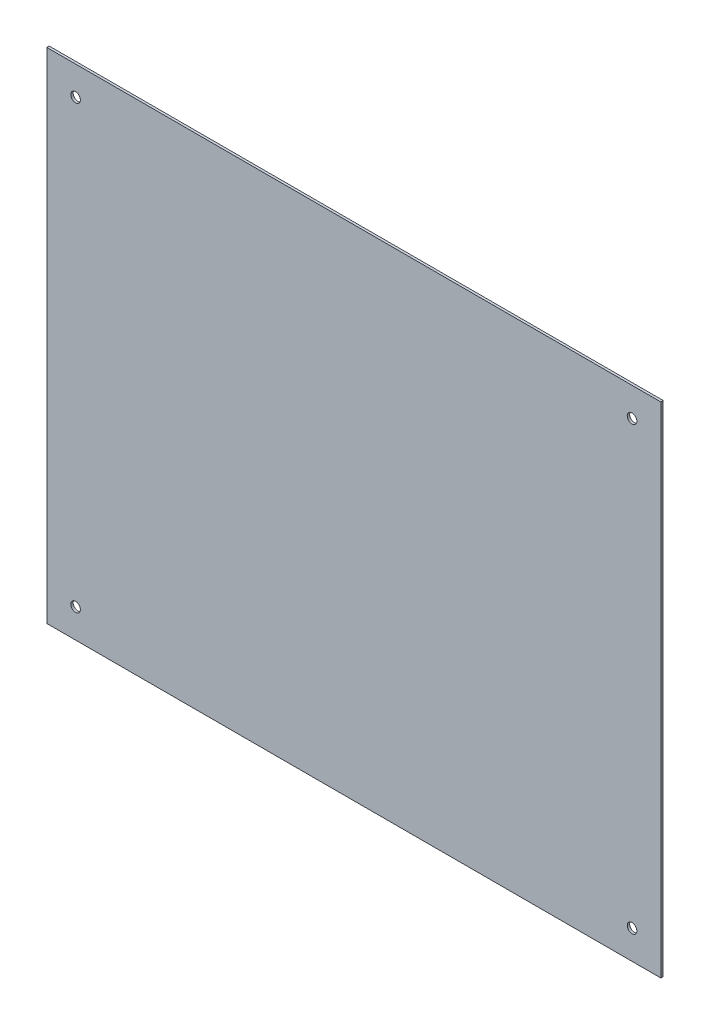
ISO-10303-21;
HEADER;
FILE_DESCRIPTION(('STEP AP214'),'2;1');
FILE_NAME('part.step','',(''),(''),'','','');
FILE_SCHEMA(('AUTOMOTIVE_DESIGN { 1 0 10303 214 1 1 1 1 }'));
ENDSEC;
DATA;
#1=APPLICATION_CONTEXT('core data for automotive mechanical design processes');
#2=APPLICATION_PROTOCOL_DEFINITION('international standard','automotive_design',2000,#1);
#3=PRODUCT_CONTEXT('',#1,'mechanical');
#4=PRODUCT('Part','Part','',(#3));
#5=PRODUCT_RELATED_PRODUCT_CATEGORY('part','',(#4));
#6=PRODUCT_DEFINITION_FORMATION('','',#4);
#7=PRODUCT_DEFINITION_CONTEXT('part definition',#1,'design');
#8=PRODUCT_DEFINITION('design','',#6,#7);
#9=PRODUCT_DEFINITION_SHAPE('','',#8);
#10=(LENGTH_UNIT() NAMED_UNIT(*) SI_UNIT(.MILLI.,.METRE.));
#11=(NAMED_UNIT(*) PLANE_ANGLE_UNIT() SI_UNIT($,.RADIAN.));
#12=(NAMED_UNIT(*) SI_UNIT($,.STERADIAN.) SOLID_ANGLE_UNIT());
#13=UNCERTAINTY_MEASURE_WITH_UNIT(LENGTH_MEASURE(1.E-05),#10,'distance_accuracy_value','');
#14=(GEOMETRIC_REPRESENTATION_CONTEXT(3) GLOBAL_UNCERTAINTY_ASSIGNED_CONTEXT((#13)) GLOBAL_UNIT_ASSIGNED_CONTEXT((#10,
#11,#12)) REPRESENTATION_CONTEXT('',''));
#15=CARTESIAN_POINT('',(0.,0.,0.));
#16=DIRECTION('',(0.,0.,1.));
#17=DIRECTION('',(1.,0.,0.));
#18=AXIS2_PLACEMENT_3D('',#15,#16,#17);
#19=CARTESIAN_POINT('',(-101.6,-82.55,0.396875));
#20=DIRECTION('',(0.,0.,1.));
#21=DIRECTION('',(1.,0.,0.));
#22=AXIS2_PLACEMENT_3D('',#19,#20,#21);
#23=PLANE('',#22);
#24=CARTESIAN_POINT('',(-92.075,-73.025,0.396875));
#25=DIRECTION('',(0.,0.,-1.));
#26=DIRECTION('',(1.,0.,0.));
#27=AXIS2_PLACEMENT_3D('',#24,#25,#26);
#28=CIRCLE('',#27,1.5875);
#29=CARTESIAN_POINT('',(-90.4875,-73.025,0.396875));
#30=VERTEX_POINT('',#29);
#31=EDGE_CURVE('E130',#30,#30,#28,.T.);
#32=ORIENTED_EDGE('',*,*,#31,.T.);
#33=EDGE_LOOP('',(#32));
#34=FACE_BOUND('',#33,.T.);
#35=CARTESIAN_POINT('',(-92.075,73.025,0.396875));
#36=DIRECTION('',(0.,0.,1.));
#37=DIRECTION('',(1.,0.,0.));
#38=AXIS2_PLACEMENT_3D('',#35,#36,#37);
#39=CIRCLE('',#38,1.5875);
#40=CARTESIAN_POINT('',(-90.4875,73.025,0.396875));
#41=VERTEX_POINT('',#40);
#42=EDGE_CURVE('E90',#41,#41,#39,.T.);
#43=ORIENTED_EDGE('',*,*,#42,.F.);
#44=EDGE_LOOP('',(#43));
#45=FACE_BOUND('',#44,.T.);
#46=DIRECTION('',(0.,-1.,0.));
#47=VECTOR('',#46,1.);
#48=CARTESIAN_POINT('',(-101.6,82.55,0.396875));
#49=LINE('',#48,#47);
#50=CARTESIAN_POINT('',(-101.6,82.55,0.396875));
#51=VERTEX_POINT('',#50);
#52=CARTESIAN_POINT('',(-101.6,-82.55,0.396875));
#53=VERTEX_POINT('',#52);
#54=EDGE_CURVE('E97',#51,#53,#49,.T.);
#55=ORIENTED_EDGE('',*,*,#54,.T.);
#56=DIRECTION('',(1.,0.,0.));
#57=VECTOR('',#56,1.);
#58=CARTESIAN_POINT('',(-101.6,-82.55,0.396875));
#59=LINE('',#58,#57);
#60=CARTESIAN_POINT('',(101.6,-82.55,0.396875));
#61=VERTEX_POINT('',#60);
#62=EDGE_CURVE('E82',#53,#61,#59,.T.);
#63=ORIENTED_EDGE('',*,*,#62,.T.);
#64=DIRECTION('',(0.,1.,0.));
#65=VECTOR('',#64,1.);
#66=CARTESIAN_POINT('',(101.6,82.55,0.396875));
#67=LINE('',#66,#65);
#68=CARTESIAN_POINT('',(101.6,82.55,0.396875));
#69=VERTEX_POINT('',#68);
#70=EDGE_CURVE('E48',#61,#69,#67,.T.);
#71=ORIENTED_EDGE('',*,*,#70,.T.);
#72=DIRECTION('',(-1.,0.,0.));
#73=VECTOR('',#72,1.);
#74=CARTESIAN_POINT('',(-101.6,82.55,0.396875));
#75=LINE('',#74,#73);
#76=EDGE_CURVE('E43',#69,#51,#75,.T.);
#77=ORIENTED_EDGE('',*,*,#76,.T.);
#78=EDGE_LOOP('',(#55,#63,#71,#77));
#79=FACE_BOUND('',#78,.T.);
#80=CARTESIAN_POINT('',(92.075,-73.025,0.396875));
#81=DIRECTION('',(0.,0.,1.));
#82=DIRECTION('',(-1.,0.,0.));
#83=AXIS2_PLACEMENT_3D('',#80,#81,#82);
#84=CIRCLE('',#83,1.5875);
#85=CARTESIAN_POINT('',(90.4875,-73.025,0.396875));
#86=VERTEX_POINT('',#85);
#87=EDGE_CURVE('E116',#86,#86,#84,.T.);
#88=ORIENTED_EDGE('',*,*,#87,.F.);
#89=EDGE_LOOP('',(#88));
#90=FACE_BOUND('',#89,.T.);
#91=CARTESIAN_POINT('',(92.075,73.025,0.396875));
#92=DIRECTION('',(0.,0.,-1.));
#93=DIRECTION('',(-1.,0.,0.));
#94=AXIS2_PLACEMENT_3D('',#91,#92,#93);
#95=CIRCLE('',#94,1.5875);
#96=CARTESIAN_POINT('',(90.4875,73.025,0.396875));
#97=VERTEX_POINT('',#96);
#98=EDGE_CURVE('E119',#97,#97,#95,.T.);
#99=ORIENTED_EDGE('',*,*,#98,.T.);
#100=EDGE_LOOP('',(#99));
#101=FACE_BOUND('',#100,.T.);
#102=ADVANCED_FACE('F28',(#34,#45,#79,#90,#101),#23,.T.);
#103=CARTESIAN_POINT('',(-101.6,-82.55,-0.396875));
#104=DIRECTION('',(0.,0.,1.));
#105=DIRECTION('',(1.,0.,0.));
#106=AXIS2_PLACEMENT_3D('',#103,#104,#105);
#107=PLANE('',#106);
#108=CARTESIAN_POINT('',(-92.075,-73.025,-0.396875));
#109=DIRECTION('',(0.,0.,-1.));
#110=DIRECTION('',(1.,0.,0.));
#111=AXIS2_PLACEMENT_3D('',#108,#109,#110);
#112=CIRCLE('',#111,1.5875);
#113=CARTESIAN_POINT('',(-90.4875,-73.025,-0.396875));
#114=VERTEX_POINT('',#113);
#115=EDGE_CURVE('E133',#114,#114,#112,.T.);
#116=ORIENTED_EDGE('',*,*,#115,.F.);
#117=EDGE_LOOP('',(#116));
#118=FACE_BOUND('',#117,.T.);
#119=CARTESIAN_POINT('',(-92.075,73.025,-0.396875));
#120=DIRECTION('',(0.,0.,1.));
#121=DIRECTION('',(1.,0.,0.));
#122=AXIS2_PLACEMENT_3D('',#119,#120,#121);
#123=CIRCLE('',#122,1.5875);
#124=CARTESIAN_POINT('',(-90.4875,73.025,-0.396875));
#125=VERTEX_POINT('',#124);
#126=EDGE_CURVE('E87',#125,#125,#123,.T.);
#127=ORIENTED_EDGE('',*,*,#126,.T.);
#128=EDGE_LOOP('',(#127));
#129=FACE_BOUND('',#128,.T.);
#130=DIRECTION('',(0.,-1.,0.));
#131=VECTOR('',#130,1.);
#132=CARTESIAN_POINT('',(-101.6,82.55,-0.396875));
#133=LINE('',#132,#131);
#134=CARTESIAN_POINT('',(-101.6,82.55,-0.396875));
#135=VERTEX_POINT('',#134);
#136=CARTESIAN_POINT('',(-101.6,-82.55,-0.396875));
#137=VERTEX_POINT('',#136);
#138=EDGE_CURVE('E74',#135,#137,#133,.T.);
#139=ORIENTED_EDGE('',*,*,#138,.F.);
#140=DIRECTION('',(-1.,0.,0.));
#141=VECTOR('',#140,1.);
#142=CARTESIAN_POINT('',(-101.6,82.55,-0.396875));
#143=LINE('',#142,#141);
#144=CARTESIAN_POINT('',(101.6,82.55,-0.396875));
#145=VERTEX_POINT('',#144);
#146=EDGE_CURVE('E95',#145,#135,#143,.T.);
#147=ORIENTED_EDGE('',*,*,#146,.F.);
#148=DIRECTION('',(0.,1.,0.));
#149=VECTOR('',#148,1.);
#150=CARTESIAN_POINT('',(101.6,82.55,-0.396875));
#151=LINE('',#150,#149);
#152=CARTESIAN_POINT('',(101.6,-82.55,-0.396875));
#153=VERTEX_POINT('',#152);
#154=EDGE_CURVE('E75',#153,#145,#151,.T.);
#155=ORIENTED_EDGE('',*,*,#154,.F.);
#156=DIRECTION('',(1.,0.,0.));
#157=VECTOR('',#156,1.);
#158=CARTESIAN_POINT('',(-101.6,-82.55,-0.396875));
#159=LINE('',#158,#157);
#160=EDGE_CURVE('E69',#137,#153,#159,.T.);
#161=ORIENTED_EDGE('',*,*,#160,.F.);
#162=EDGE_LOOP('',(#139,#147,#155,#161));
#163=FACE_BOUND('',#162,.T.);
#164=CARTESIAN_POINT('',(92.075,-73.025,-0.396875));
#165=DIRECTION('',(0.,0.,1.));
#166=DIRECTION('',(-1.,0.,0.));
#167=AXIS2_PLACEMENT_3D('',#164,#165,#166);
#168=CIRCLE('',#167,1.5875);
#169=CARTESIAN_POINT('',(90.4875,-73.025,-0.396875));
#170=VERTEX_POINT('',#169);
#171=EDGE_CURVE('E127',#170,#170,#168,.T.);
#172=ORIENTED_EDGE('',*,*,#171,.T.);
#173=EDGE_LOOP('',(#172));
#174=FACE_BOUND('',#173,.T.);
#175=CARTESIAN_POINT('',(92.075,73.025,-0.396875));
#176=DIRECTION('',(0.,0.,-1.));
#177=DIRECTION('',(-1.,0.,0.));
#178=AXIS2_PLACEMENT_3D('',#175,#176,#177);
#179=CIRCLE('',#178,1.5875);
#180=CARTESIAN_POINT('',(90.4875,73.025,-0.396875));
#181=VERTEX_POINT('',#180);
#182=EDGE_CURVE('E121',#181,#181,#179,.T.);
#183=ORIENTED_EDGE('',*,*,#182,.F.);
#184=EDGE_LOOP('',(#183));
#185=FACE_BOUND('',#184,.T.);
#186=ADVANCED_FACE('F70',(#118,#129,#163,#174,#185),#107,.F.);
#187=CARTESIAN_POINT('',(-101.6,82.55,0.396875));
#188=DIRECTION('',(1.,0.,0.));
#189=DIRECTION('',(0.,1.,0.));
#190=AXIS2_PLACEMENT_3D('',#187,#188,#189);
#191=PLANE('',#190);
#192=ORIENTED_EDGE('',*,*,#138,.T.);
#193=DIRECTION('',(0.,0.,-1.));
#194=VECTOR('',#193,1.);
#195=CARTESIAN_POINT('',(-101.6,-82.55,0.396875));
#196=LINE('',#195,#194);
#197=EDGE_CURVE('E11',#53,#137,#196,.T.);
#198=ORIENTED_EDGE('',*,*,#197,.F.);
#199=ORIENTED_EDGE('',*,*,#54,.F.);
#200=DIRECTION('',(0.,0.,-1.));
#201=VECTOR('',#200,1.);
#202=CARTESIAN_POINT('',(-101.6,82.55,0.396875));
#203=LINE('',#202,#201);
#204=EDGE_CURVE('E86',#51,#135,#203,.T.);
#205=ORIENTED_EDGE('',*,*,#204,.T.);
#206=EDGE_LOOP('',(#192,#198,#199,#205));
#207=FACE_BOUND('',#206,.T.);
#208=ADVANCED_FACE('F30',(#207),#191,.F.);
#209=CARTESIAN_POINT('',(-101.6,-82.55,0.396875));
#210=DIRECTION('',(0.,1.,0.));
#211=DIRECTION('',(0.,0.,1.));
#212=AXIS2_PLACEMENT_3D('',#209,#210,#211);
#213=PLANE('',#212);
#214=ORIENTED_EDGE('',*,*,#160,.T.);
#215=DIRECTION('',(0.,0.,-1.));
#216=VECTOR('',#215,1.);
#217=CARTESIAN_POINT('',(101.6,-82.55,0.396875));
#218=LINE('',#217,#216);
#219=EDGE_CURVE('E36',#61,#153,#218,.T.);
#220=ORIENTED_EDGE('',*,*,#219,.F.);
#221=ORIENTED_EDGE('',*,*,#62,.F.);
#222=ORIENTED_EDGE('',*,*,#197,.T.);
#223=EDGE_LOOP('',(#214,#220,#221,#222));
#224=FACE_BOUND('',#223,.T.);
#225=ADVANCED_FACE('F81',(#224),#213,.F.);
#226=CARTESIAN_POINT('',(101.6,82.55,0.396875));
#227=DIRECTION('',(-1.,0.,0.));
#228=DIRECTION('',(0.,-1.,0.));
#229=AXIS2_PLACEMENT_3D('',#226,#227,#228);
#230=PLANE('',#229);
#231=ORIENTED_EDGE('',*,*,#154,.T.);
#232=DIRECTION('',(0.,0.,-1.));
#233=VECTOR('',#232,1.);
#234=CARTESIAN_POINT('',(101.6,82.55,0.396875));
#235=LINE('',#234,#233);
#236=EDGE_CURVE('E103',#69,#145,#235,.T.);
#237=ORIENTED_EDGE('',*,*,#236,.F.);
#238=ORIENTED_EDGE('',*,*,#70,.F.);
#239=ORIENTED_EDGE('',*,*,#219,.T.);
#240=EDGE_LOOP('',(#231,#237,#238,#239));
#241=FACE_BOUND('',#240,.T.);
#242=ADVANCED_FACE('F106',(#241),#230,.F.);
#243=CARTESIAN_POINT('',(-101.6,82.55,0.396875));
#244=DIRECTION('',(0.,-1.,0.));
#245=DIRECTION('',(0.,0.,-1.));
#246=AXIS2_PLACEMENT_3D('',#243,#244,#245);
#247=PLANE('',#246);
#248=ORIENTED_EDGE('',*,*,#146,.T.);
#249=ORIENTED_EDGE('',*,*,#204,.F.);
#250=ORIENTED_EDGE('',*,*,#76,.F.);
#251=ORIENTED_EDGE('',*,*,#236,.T.);
#252=EDGE_LOOP('',(#248,#249,#250,#251));
#253=FACE_BOUND('',#252,.T.);
#254=ADVANCED_FACE('F108',(#253),#247,.F.);
#255=CARTESIAN_POINT('',(-92.075,73.025,-0.396875));
#256=DIRECTION('',(0.,0.,1.));
#257=DIRECTION('',(1.,0.,0.));
#258=AXIS2_PLACEMENT_3D('',#255,#256,#257);
#259=CYLINDRICAL_SURFACE('',#258,1.5875);
#260=ORIENTED_EDGE('',*,*,#126,.F.);
#261=EDGE_LOOP('',(#260));
#262=FACE_BOUND('',#261,.T.);
#263=ORIENTED_EDGE('',*,*,#42,.T.);
#264=EDGE_LOOP('',(#263));
#265=FACE_BOUND('',#264,.T.);
#266=ADVANCED_FACE('F138',(#262,#265),#259,.F.);
#267=CARTESIAN_POINT('',(-92.075,-73.025,-0.396875));
#268=DIRECTION('',(0.,0.,1.));
#269=DIRECTION('',(1.,0.,0.));
#270=AXIS2_PLACEMENT_3D('',#267,#268,#269);
#271=CYLINDRICAL_SURFACE('',#270,1.5875);
#272=ORIENTED_EDGE('',*,*,#115,.T.);
#273=EDGE_LOOP('',(#272));
#274=FACE_BOUND('',#273,.T.);
#275=ORIENTED_EDGE('',*,*,#31,.F.);
#276=EDGE_LOOP('',(#275));
#277=FACE_BOUND('',#276,.T.);
#278=ADVANCED_FACE('F141',(#274,#277),#271,.F.);
#279=CARTESIAN_POINT('',(92.075,-73.025,-0.396875));
#280=DIRECTION('',(0.,0.,1.));
#281=DIRECTION('',(1.,0.,0.));
#282=AXIS2_PLACEMENT_3D('',#279,#280,#281);
#283=CYLINDRICAL_SURFACE('',#282,1.5875);
#284=ORIENTED_EDGE('',*,*,#171,.F.);
#285=EDGE_LOOP('',(#284));
#286=FACE_BOUND('',#285,.T.);
#287=ORIENTED_EDGE('',*,*,#87,.T.);
#288=EDGE_LOOP('',(#287));
#289=FACE_BOUND('',#288,.T.);
#290=ADVANCED_FACE('F148',(#286,#289),#283,.F.);
#291=CARTESIAN_POINT('',(92.075,73.025,-0.396875));
#292=DIRECTION('',(0.,0.,1.));
#293=DIRECTION('',(1.,0.,0.));
#294=AXIS2_PLACEMENT_3D('',#291,#292,#293);
#295=CYLINDRICAL_SURFACE('',#294,1.5875);
#296=ORIENTED_EDGE('',*,*,#182,.T.);
#297=EDGE_LOOP('',(#296));
#298=FACE_BOUND('',#297,.T.);
#299=ORIENTED_EDGE('',*,*,#98,.F.);
#300=EDGE_LOOP('',(#299));
#301=FACE_BOUND('',#300,.T.);
#302=ADVANCED_FACE('F196',(#298,#301),#295,.F.);
#303=CLOSED_SHELL('',(#102,#186,#208,#225,#242,#254,#266,#278,#290,#302));
#304=MANIFOLD_SOLID_BREP('B2',#303);
#305=ADVANCED_BREP_SHAPE_REPRESENTATION('',(#18,#304),#14);
#306=SHAPE_DEFINITION_REPRESENTATION(#9,#305);
ENDSEC;
END-ISO-10303-21;
